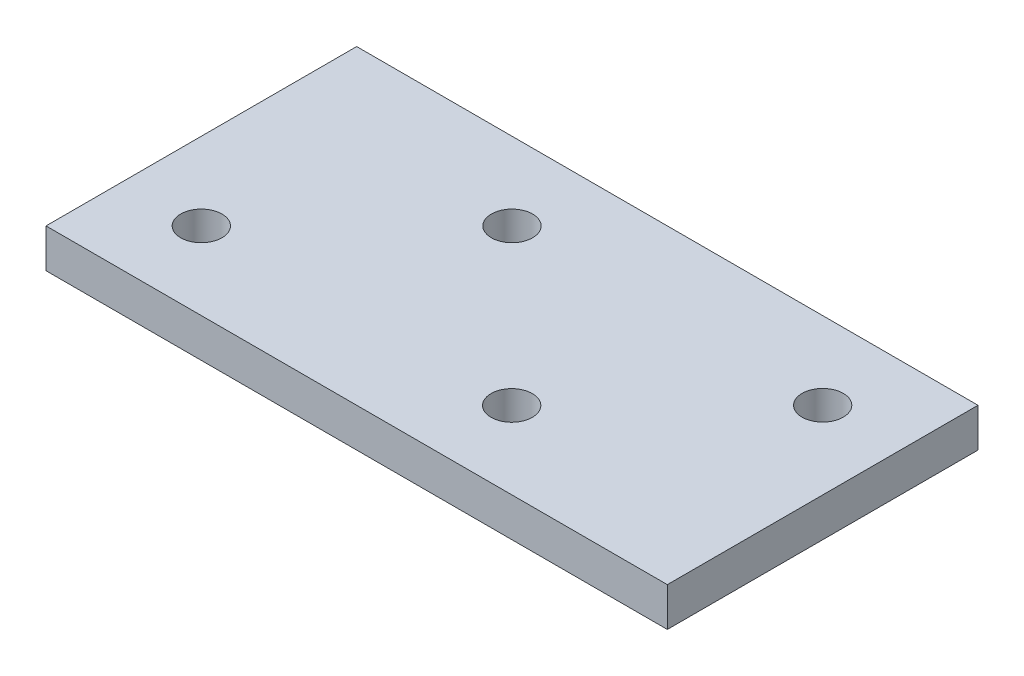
from build123d import *

# Parameters (mm, degrees)
SKETCH1_W      = 101.6
SKETCH1_H      = 50.8
SKETCH1_R      = 3.37312
EXTRUDE1_DEPTH = 6.35


with BuildPart() as part:
    # Sketch1 → Extrude1 (new body)
    with BuildSketch(Plane(origin=(0, 0, 0), x_dir=(1, 0, 0), z_dir=(0, 1, 0))):
        with Locations((50.8, 25.4)):
            Rectangle(SKETCH1_W, SKETCH1_H)
        with Locations(Location((12.7, 12.7, 0), (0, 0, 270))):
            Circle(SKETCH1_R, mode=Mode.SUBTRACT)
        with Locations(Location((38.1, 38.1, 0), (0, 0, 270))):
            Circle(SKETCH1_R, mode=Mode.SUBTRACT)
        with Locations(Location((88.9, 38.1, 0), (0, 0, 270))):
            Circle(SKETCH1_R, mode=Mode.SUBTRACT)
        with Locations(Location((63.5, 12.646563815, 0), (0, 0, 270))):
            Circle(SKETCH1_R, mode=Mode.SUBTRACT)
    extrude(amount=EXTRUDE1_DEPTH)


solid = part.part
